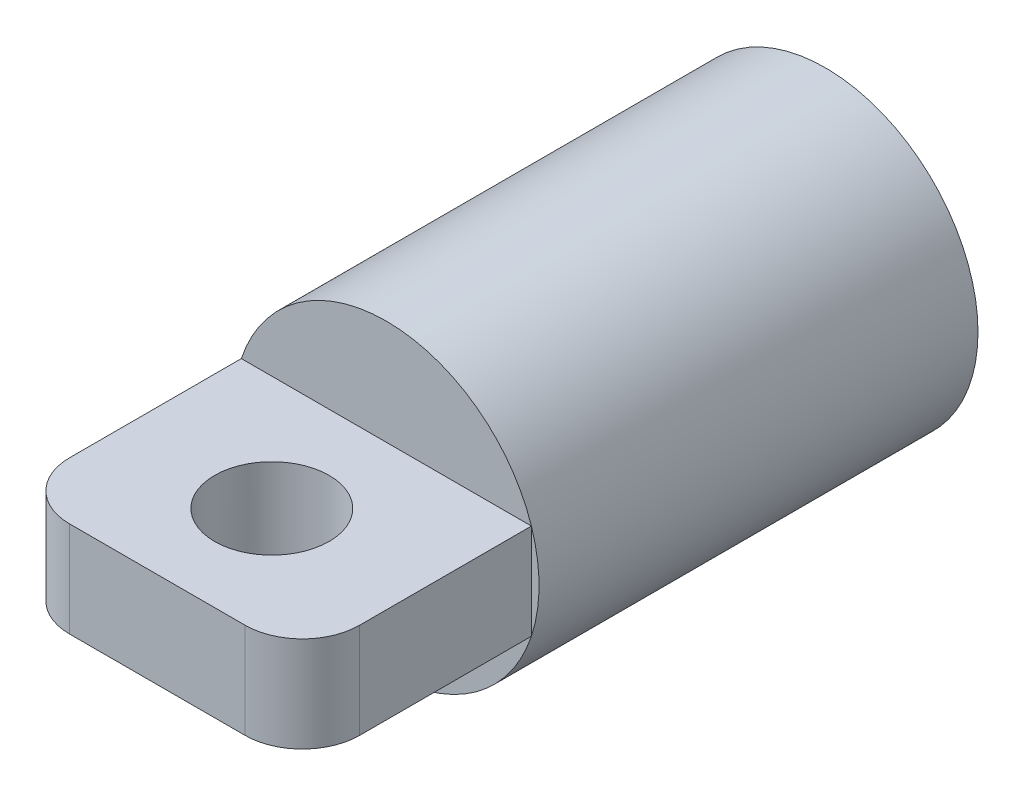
from build123d import *

# Parameters (mm, degrees)
SKETCH1_R           = 8
BOSS_EXTRUDE1_DEPTH = 35
SKETCH2_OUTSIDE_W   = 26.336
SKETCH2_OUTSIDE_H   = 26.336
SKETCH2_OUTSIDE_W_2 = 15.198684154
SKETCH2_OUTSIDE_H_2 = 5
CUT_EXTRUDE1_DEPTH  = 12
FILLET2_R           = 3
SKETCH4_R           = 3
CUT_EXTRUDE2_DEPTH  = 8


with BuildPart() as part:
    # Sketch1 → Boss-Extrude1 (new body)
    with BuildSketch(Plane.XY):
        Circle(SKETCH1_R)
    extrude(amount=BOSS_EXTRUDE1_DEPTH)

    # Sketch2 outside → Cut-Extrude1 (cut)
    with BuildSketch(Plane.XY.offset(35)):
        Rectangle(SKETCH2_OUTSIDE_W, SKETCH2_OUTSIDE_H)
        Rectangle(SKETCH2_OUTSIDE_W_2, SKETCH2_OUTSIDE_H_2, mode=Mode.SUBTRACT)
    extrude(amount=-CUT_EXTRUDE1_DEPTH, mode=Mode.SUBTRACT)

    # Fillet2
    fillet2_edges = [part.edges().sort_by_distance(p)[0] for p in [
        (7.599342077, 0, 35),
        (-7.599342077, 0, 35),
    ]]
    fillet(fillet2_edges, radius=FILLET2_R)

    # Sketch4 → Cut-Extrude2 (cut)
    with BuildSketch(Plane.XZ.offset(2.5)):
        with Locations(Location((0, 29, 0), (0, 0, 270))):
            Circle(SKETCH4_R)
    extrude(amount=-CUT_EXTRUDE2_DEPTH, mode=Mode.SUBTRACT)


solid = part.part
